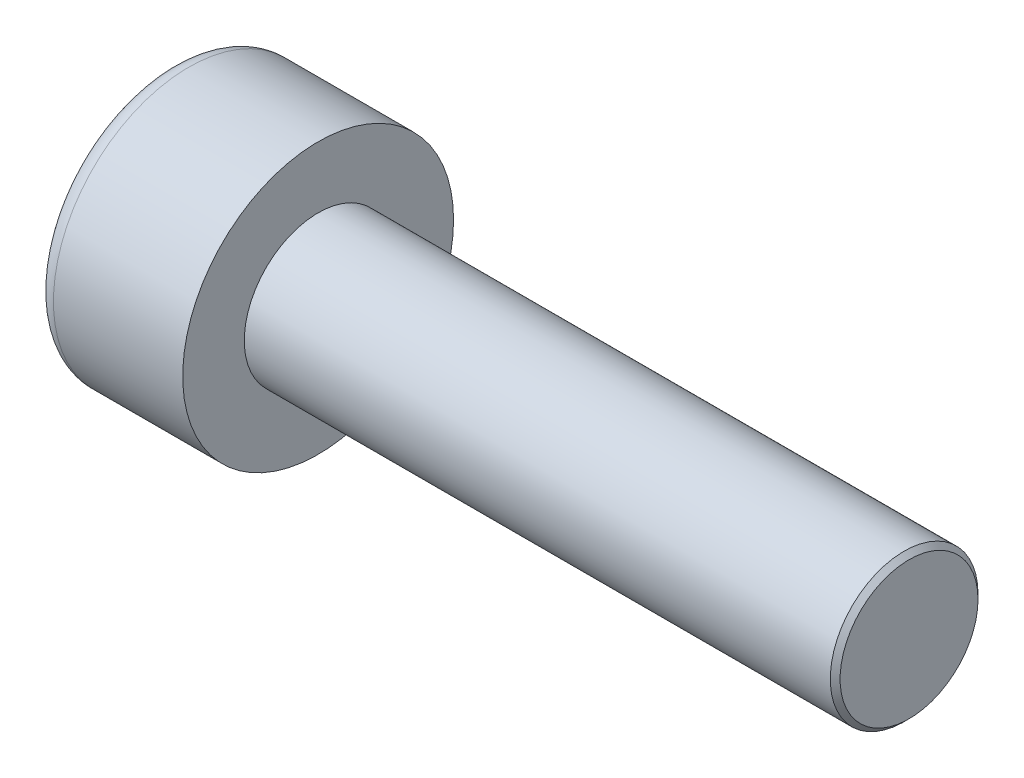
ISO-10303-21;
HEADER;
FILE_DESCRIPTION(('STEP AP214'),'2;1');
FILE_NAME('part.step','',(''),(''),'','','');
FILE_SCHEMA(('AUTOMOTIVE_DESIGN { 1 0 10303 214 1 1 1 1 }'));
ENDSEC;
DATA;
#1=APPLICATION_CONTEXT('core data for automotive mechanical design processes');
#2=APPLICATION_PROTOCOL_DEFINITION('international standard','automotive_design',2000,#1);
#3=PRODUCT_CONTEXT('',#1,'mechanical');
#4=PRODUCT('Part','Part','',(#3));
#5=PRODUCT_RELATED_PRODUCT_CATEGORY('part','',(#4));
#6=PRODUCT_DEFINITION_FORMATION('','',#4);
#7=PRODUCT_DEFINITION_CONTEXT('part definition',#1,'design');
#8=PRODUCT_DEFINITION('design','',#6,#7);
#9=PRODUCT_DEFINITION_SHAPE('','',#8);
#10=(LENGTH_UNIT() NAMED_UNIT(*) SI_UNIT(.MILLI.,.METRE.));
#11=(NAMED_UNIT(*) PLANE_ANGLE_UNIT() SI_UNIT($,.RADIAN.));
#12=(NAMED_UNIT(*) SI_UNIT($,.STERADIAN.) SOLID_ANGLE_UNIT());
#13=UNCERTAINTY_MEASURE_WITH_UNIT(LENGTH_MEASURE(1.E-05),#10,'distance_accuracy_value','');
#14=(GEOMETRIC_REPRESENTATION_CONTEXT(3) GLOBAL_UNCERTAINTY_ASSIGNED_CONTEXT((#13)) GLOBAL_UNIT_ASSIGNED_CONTEXT((#10,
#11,#12)) REPRESENTATION_CONTEXT('',''));
#15=CARTESIAN_POINT('',(0.,0.,0.));
#16=DIRECTION('',(0.,0.,1.));
#17=DIRECTION('',(1.,0.,0.));
#18=AXIS2_PLACEMENT_3D('',#15,#16,#17);
#19=CARTESIAN_POINT('',(1.3,0.,-1.44337567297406));
#20=DIRECTION('',(1.,0.,0.));
#21=DIRECTION('',(0.,0.,-1.));
#22=AXIS2_PLACEMENT_3D('',#19,#20,#21);
#23=PLANE('',#22);
#24=CARTESIAN_POINT('',(1.3,0.,0.));
#25=DIRECTION('',(1.,0.,0.));
#26=DIRECTION('',(0.,0.,-1.));
#27=AXIS2_PLACEMENT_3D('',#24,#25,#26);
#28=CIRCLE('',#27,1.25);
#29=CARTESIAN_POINT('',(1.3,-0.625,-1.08253175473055));
#30=VERTEX_POINT('',#29);
#31=CARTESIAN_POINT('',(1.3,-1.25,0.));
#32=VERTEX_POINT('',#31);
#33=EDGE_CURVE('E164',#30,#32,#28,.F.);
#34=ORIENTED_EDGE('',*,*,#33,.F.);
#35=DIRECTION('',(0.,0.866025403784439,-0.5));
#36=VECTOR('',#35,1.);
#37=CARTESIAN_POINT('',(1.3,-1.25,-0.721687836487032));
#38=LINE('',#37,#36);
#39=CARTESIAN_POINT('',(1.3,-1.25,-0.721687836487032));
#40=VERTEX_POINT('',#39);
#41=EDGE_CURVE('E172',#40,#30,#38,.T.);
#42=ORIENTED_EDGE('',*,*,#41,.F.);
#43=DIRECTION('',(0.,0.,-1.));
#44=VECTOR('',#43,1.);
#45=CARTESIAN_POINT('',(1.3,-1.25,0.721687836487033));
#46=LINE('',#45,#44);
#47=EDGE_CURVE('E189',#32,#40,#46,.T.);
#48=ORIENTED_EDGE('',*,*,#47,.F.);
#49=EDGE_LOOP('',(#34,#42,#48));
#50=FACE_BOUND('',#49,.T.);
#51=ADVANCED_FACE('F41',(#50),#23,.F.);
#52=CARTESIAN_POINT('',(1.3,-0.625,1.08253175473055));
#53=VERTEX_POINT('',#52);
#54=EDGE_CURVE('E294',#32,#53,#28,.F.);
#55=ORIENTED_EDGE('',*,*,#54,.F.);
#56=CARTESIAN_POINT('',(1.3,-1.25,0.721687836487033));
#57=VERTEX_POINT('',#56);
#58=EDGE_CURVE('E190',#57,#32,#46,.T.);
#59=ORIENTED_EDGE('',*,*,#58,.F.);
#60=DIRECTION('',(0.,-0.866025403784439,-0.5));
#61=VECTOR('',#60,1.);
#62=CARTESIAN_POINT('',(1.3,0.,1.44337567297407));
#63=LINE('',#62,#61);
#64=EDGE_CURVE('E185',#53,#57,#63,.T.);
#65=ORIENTED_EDGE('',*,*,#64,.F.);
#66=EDGE_LOOP('',(#55,#59,#65));
#67=FACE_BOUND('',#66,.T.);
#68=ADVANCED_FACE('F130',(#67),#23,.F.);
#69=CARTESIAN_POINT('',(1.3,0.625,1.08253175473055));
#70=VERTEX_POINT('',#69);
#71=EDGE_CURVE('E290',#53,#70,#28,.F.);
#72=ORIENTED_EDGE('',*,*,#71,.F.);
#73=CARTESIAN_POINT('',(1.3,0.,1.44337567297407));
#74=VERTEX_POINT('',#73);
#75=EDGE_CURVE('E186',#74,#53,#63,.T.);
#76=ORIENTED_EDGE('',*,*,#75,.F.);
#77=DIRECTION('',(0.,-0.866025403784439,0.5));
#78=VECTOR('',#77,1.);
#79=CARTESIAN_POINT('',(1.3,1.25,0.721687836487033));
#80=LINE('',#79,#78);
#81=EDGE_CURVE('E181',#70,#74,#80,.T.);
#82=ORIENTED_EDGE('',*,*,#81,.F.);
#83=EDGE_LOOP('',(#72,#76,#82));
#84=FACE_BOUND('',#83,.T.);
#85=ADVANCED_FACE('F136',(#84),#23,.F.);
#86=CARTESIAN_POINT('',(1.3,1.25,0.));
#87=VERTEX_POINT('',#86);
#88=EDGE_CURVE('E161',#70,#87,#28,.F.);
#89=ORIENTED_EDGE('',*,*,#88,.F.);
#90=CARTESIAN_POINT('',(1.3,1.25,0.721687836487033));
#91=VERTEX_POINT('',#90);
#92=EDGE_CURVE('E182',#91,#70,#80,.T.);
#93=ORIENTED_EDGE('',*,*,#92,.F.);
#94=DIRECTION('',(0.,0.,1.));
#95=VECTOR('',#94,1.);
#96=CARTESIAN_POINT('',(1.3,1.25,-0.721687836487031));
#97=LINE('',#96,#95);
#98=EDGE_CURVE('E176',#87,#91,#97,.T.);
#99=ORIENTED_EDGE('',*,*,#98,.F.);
#100=EDGE_LOOP('',(#89,#93,#99));
#101=FACE_BOUND('',#100,.T.);
#102=ADVANCED_FACE('F150',(#101),#23,.F.);
#103=CARTESIAN_POINT('',(1.3,0.,0.));
#104=DIRECTION('',(1.,0.,0.));
#105=DIRECTION('',(0.,0.,-1.));
#106=AXIS2_PLACEMENT_3D('',#103,#104,#105);
#107=CIRCLE('',#106,1.25);
#108=CARTESIAN_POINT('',(1.3,0.625,-1.08253175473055));
#109=VERTEX_POINT('',#108);
#110=EDGE_CURVE('E56',#109,#87,#107,.T.);
#111=ORIENTED_EDGE('',*,*,#110,.T.);
#112=CARTESIAN_POINT('',(1.3,1.25,-0.721687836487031));
#113=VERTEX_POINT('',#112);
#114=EDGE_CURVE('E169',#113,#87,#97,.T.);
#115=ORIENTED_EDGE('',*,*,#114,.F.);
#116=DIRECTION('',(0.,0.866025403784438,0.5));
#117=VECTOR('',#116,1.);
#118=CARTESIAN_POINT('',(1.3,0.,-1.44337567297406));
#119=LINE('',#118,#117);
#120=EDGE_CURVE('E166',#109,#113,#119,.T.);
#121=ORIENTED_EDGE('',*,*,#120,.F.);
#122=EDGE_LOOP('',(#111,#115,#121));
#123=FACE_BOUND('',#122,.T.);
#124=ADVANCED_FACE('F141',(#123),#23,.F.);
#125=EDGE_CURVE('E154',#109,#30,#28,.F.);
#126=ORIENTED_EDGE('',*,*,#125,.F.);
#127=CARTESIAN_POINT('',(1.3,0.,-1.44337567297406));
#128=VERTEX_POINT('',#127);
#129=EDGE_CURVE('E157',#128,#109,#119,.T.);
#130=ORIENTED_EDGE('',*,*,#129,.F.);
#131=EDGE_CURVE('E159',#30,#128,#38,.T.);
#132=ORIENTED_EDGE('',*,*,#131,.F.);
#133=EDGE_LOOP('',(#126,#130,#132));
#134=FACE_BOUND('',#133,.T.);
#135=ADVANCED_FACE('F132',(#134),#23,.F.);
#136=CARTESIAN_POINT('',(0.,0.,0.));
#137=DIRECTION('',(1.,0.,0.));
#138=DIRECTION('',(0.,0.,-1.));
#139=AXIS2_PLACEMENT_3D('',#136,#137,#138);
#140=PLANE('',#139);
#141=CARTESIAN_POINT('',(0.,0.,0.));
#142=DIRECTION('',(1.,0.,0.));
#143=DIRECTION('',(0.,0.,-1.));
#144=AXIS2_PLACEMENT_3D('',#141,#142,#143);
#145=CIRCLE('',#144,2.375);
#146=CARTESIAN_POINT('',(0.,0.,-2.375));
#147=VERTEX_POINT('',#146);
#148=EDGE_CURVE('E229',#147,#147,#145,.F.);
#149=ORIENTED_EDGE('',*,*,#148,.T.);
#150=EDGE_LOOP('',(#149));
#151=FACE_BOUND('',#150,.T.);
#152=DIRECTION('',(0.,0.866025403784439,-0.5));
#153=VECTOR('',#152,1.);
#154=CARTESIAN_POINT('',(0.,-1.25,-0.721687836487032));
#155=LINE('',#154,#153);
#156=CARTESIAN_POINT('',(0.,-1.25,-0.721687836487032));
#157=VERTEX_POINT('',#156);
#158=CARTESIAN_POINT('',(0.,0.,-1.44337567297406));
#159=VERTEX_POINT('',#158);
#160=EDGE_CURVE('E64',#157,#159,#155,.T.);
#161=ORIENTED_EDGE('',*,*,#160,.T.);
#162=DIRECTION('',(0.,0.866025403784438,0.5));
#163=VECTOR('',#162,1.);
#164=CARTESIAN_POINT('',(0.,0.,-1.44337567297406));
#165=LINE('',#164,#163);
#166=CARTESIAN_POINT('',(0.,1.25,-0.721687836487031));
#167=VERTEX_POINT('',#166);
#168=EDGE_CURVE('E195',#159,#167,#165,.T.);
#169=ORIENTED_EDGE('',*,*,#168,.T.);
#170=DIRECTION('',(0.,0.,1.));
#171=VECTOR('',#170,1.);
#172=CARTESIAN_POINT('',(0.,1.25,-0.721687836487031));
#173=LINE('',#172,#171);
#174=CARTESIAN_POINT('',(0.,1.25,0.721687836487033));
#175=VERTEX_POINT('',#174);
#176=EDGE_CURVE('E198',#167,#175,#173,.T.);
#177=ORIENTED_EDGE('',*,*,#176,.T.);
#178=DIRECTION('',(0.,-0.866025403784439,0.5));
#179=VECTOR('',#178,1.);
#180=CARTESIAN_POINT('',(0.,1.25,0.721687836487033));
#181=LINE('',#180,#179);
#182=CARTESIAN_POINT('',(0.,0.,1.44337567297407));
#183=VERTEX_POINT('',#182);
#184=EDGE_CURVE('E201',#175,#183,#181,.T.);
#185=ORIENTED_EDGE('',*,*,#184,.T.);
#186=DIRECTION('',(0.,-0.866025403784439,-0.5));
#187=VECTOR('',#186,1.);
#188=CARTESIAN_POINT('',(0.,0.,1.44337567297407));
#189=LINE('',#188,#187);
#190=CARTESIAN_POINT('',(0.,-1.25,0.721687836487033));
#191=VERTEX_POINT('',#190);
#192=EDGE_CURVE('E204',#183,#191,#189,.T.);
#193=ORIENTED_EDGE('',*,*,#192,.T.);
#194=DIRECTION('',(0.,0.,-1.));
#195=VECTOR('',#194,1.);
#196=CARTESIAN_POINT('',(0.,-1.25,0.721687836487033));
#197=LINE('',#196,#195);
#198=EDGE_CURVE('E207',#191,#157,#197,.T.);
#199=ORIENTED_EDGE('',*,*,#198,.T.);
#200=EDGE_LOOP('',(#161,#169,#177,#185,#193,#199));
#201=FACE_BOUND('',#200,.T.);
#202=ADVANCED_FACE('F140',(#151,#201),#140,.F.);
#203=CARTESIAN_POINT('',(3.,0.,0.));
#204=DIRECTION('',(1.,0.,0.));
#205=DIRECTION('',(0.,0.,-1.));
#206=AXIS2_PLACEMENT_3D('',#203,#204,#205);
#207=PLANE('',#206);
#208=CARTESIAN_POINT('',(3.,0.,0.));
#209=DIRECTION('',(1.,0.,0.));
#210=DIRECTION('',(0.,0.,-1.));
#211=AXIS2_PLACEMENT_3D('',#208,#209,#210);
#212=CIRCLE('',#211,2.75);
#213=CARTESIAN_POINT('',(3.,0.,-2.75));
#214=VERTEX_POINT('',#213);
#215=EDGE_CURVE('E162',#214,#214,#212,.T.);
#216=ORIENTED_EDGE('',*,*,#215,.T.);
#217=EDGE_LOOP('',(#216));
#218=FACE_BOUND('',#217,.T.);
#219=CARTESIAN_POINT('',(3.,0.,0.));
#220=DIRECTION('',(1.,0.,0.));
#221=DIRECTION('',(0.,0.,-1.));
#222=AXIS2_PLACEMENT_3D('',#219,#220,#221);
#223=CIRCLE('',#222,1.5);
#224=CARTESIAN_POINT('',(3.,0.,-1.5));
#225=VERTEX_POINT('',#224);
#226=EDGE_CURVE('E220',#225,#225,#223,.T.);
#227=ORIENTED_EDGE('',*,*,#226,.F.);
#228=EDGE_LOOP('',(#227));
#229=FACE_BOUND('',#228,.T.);
#230=ADVANCED_FACE('F147',(#218,#229),#207,.T.);
#231=CARTESIAN_POINT('',(3.,0.,0.));
#232=DIRECTION('',(-1.,0.,0.));
#233=DIRECTION('',(0.,0.,1.));
#234=AXIS2_PLACEMENT_3D('',#231,#232,#233);
#235=CYLINDRICAL_SURFACE('',#234,2.75);
#236=CARTESIAN_POINT('',(0.375,0.,0.));
#237=DIRECTION('',(1.,0.,0.));
#238=DIRECTION('',(0.,0.,-1.));
#239=AXIS2_PLACEMENT_3D('',#236,#237,#238);
#240=CIRCLE('',#239,2.75);
#241=CARTESIAN_POINT('',(0.375,0.,-2.75));
#242=VERTEX_POINT('',#241);
#243=EDGE_CURVE('E226',#242,#242,#240,.T.);
#244=ORIENTED_EDGE('',*,*,#243,.T.);
#245=EDGE_LOOP('',(#244));
#246=FACE_BOUND('',#245,.T.);
#247=ORIENTED_EDGE('',*,*,#215,.F.);
#248=EDGE_LOOP('',(#247));
#249=FACE_BOUND('',#248,.T.);
#250=ADVANCED_FACE('F245',(#246,#249),#235,.T.);
#251=CARTESIAN_POINT('',(15.,0.,0.));
#252=DIRECTION('',(-1.,0.,0.));
#253=DIRECTION('',(0.,0.,1.));
#254=AXIS2_PLACEMENT_3D('',#251,#252,#253);
#255=CYLINDRICAL_SURFACE('',#254,1.5);
#256=CARTESIAN_POINT('',(14.9,0.,0.));
#257=DIRECTION('',(1.,0.,0.));
#258=DIRECTION('',(0.,0.,-1.));
#259=AXIS2_PLACEMENT_3D('',#256,#257,#258);
#260=CIRCLE('',#259,1.5);
#261=CARTESIAN_POINT('',(14.9,0.,-1.5));
#262=VERTEX_POINT('',#261);
#263=EDGE_CURVE('E11',#262,#262,#260,.F.);
#264=ORIENTED_EDGE('',*,*,#263,.T.);
#265=EDGE_LOOP('',(#264));
#266=FACE_BOUND('',#265,.T.);
#267=ORIENTED_EDGE('',*,*,#226,.T.);
#268=EDGE_LOOP('',(#267));
#269=FACE_BOUND('',#268,.T.);
#270=ADVANCED_FACE('F242',(#266,#269),#255,.T.);
#271=CARTESIAN_POINT('',(15.,0.,0.));
#272=DIRECTION('',(1.,0.,0.));
#273=DIRECTION('',(0.,0.,-1.));
#274=AXIS2_PLACEMENT_3D('',#271,#272,#273);
#275=PLANE('',#274);
#276=CARTESIAN_POINT('',(15.,0.,0.));
#277=DIRECTION('',(1.,0.,0.));
#278=DIRECTION('',(0.,0.,-1.));
#279=AXIS2_PLACEMENT_3D('',#276,#277,#278);
#280=CIRCLE('',#279,1.4);
#281=CARTESIAN_POINT('',(15.,0.,-1.4));
#282=VERTEX_POINT('',#281);
#283=EDGE_CURVE('E49',#282,#282,#280,.T.);
#284=ORIENTED_EDGE('',*,*,#283,.T.);
#285=EDGE_LOOP('',(#284));
#286=FACE_BOUND('',#285,.T.);
#287=ADVANCED_FACE('F234',(#286),#275,.T.);
#288=CARTESIAN_POINT('',(1.3,-1.25,-0.721687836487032));
#289=DIRECTION('',(0.,0.5,0.866025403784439));
#290=DIRECTION('',(0.,-0.866025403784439,0.5));
#291=AXIS2_PLACEMENT_3D('',#288,#289,#290);
#292=PLANE('',#291);
#293=ORIENTED_EDGE('',*,*,#160,.F.);
#294=DIRECTION('',(-1.,0.,0.));
#295=VECTOR('',#294,1.);
#296=CARTESIAN_POINT('',(1.3,-1.25,-0.721687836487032));
#297=LINE('',#296,#295);
#298=EDGE_CURVE('E193',#40,#157,#297,.T.);
#299=ORIENTED_EDGE('',*,*,#298,.F.);
#300=ORIENTED_EDGE('',*,*,#41,.T.);
#301=ORIENTED_EDGE('',*,*,#131,.T.);
#302=DIRECTION('',(-1.,0.,0.));
#303=VECTOR('',#302,1.);
#304=CARTESIAN_POINT('',(1.3,0.,-1.44337567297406));
#305=LINE('',#304,#303);
#306=EDGE_CURVE('E175',#128,#159,#305,.T.);
#307=ORIENTED_EDGE('',*,*,#306,.T.);
#308=EDGE_LOOP('',(#293,#299,#300,#301,#307));
#309=FACE_BOUND('',#308,.T.);
#310=ADVANCED_FACE('F260',(#309),#292,.T.);
#311=CARTESIAN_POINT('',(1.3,0.,-1.44337567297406));
#312=DIRECTION('',(0.,-0.5,0.866025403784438));
#313=DIRECTION('',(0.,-0.866025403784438,-0.5));
#314=AXIS2_PLACEMENT_3D('',#311,#312,#313);
#315=PLANE('',#314);
#316=ORIENTED_EDGE('',*,*,#168,.F.);
#317=ORIENTED_EDGE('',*,*,#306,.F.);
#318=ORIENTED_EDGE('',*,*,#129,.T.);
#319=ORIENTED_EDGE('',*,*,#120,.T.);
#320=DIRECTION('',(-1.,0.,0.));
#321=VECTOR('',#320,1.);
#322=CARTESIAN_POINT('',(1.3,1.25,-0.721687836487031));
#323=LINE('',#322,#321);
#324=EDGE_CURVE('E217',#113,#167,#323,.T.);
#325=ORIENTED_EDGE('',*,*,#324,.T.);
#326=EDGE_LOOP('',(#316,#317,#318,#319,#325));
#327=FACE_BOUND('',#326,.T.);
#328=ADVANCED_FACE('F174',(#327),#315,.T.);
#329=CARTESIAN_POINT('',(1.3,1.25,-0.721687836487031));
#330=DIRECTION('',(0.,-1.,0.));
#331=DIRECTION('',(0.,0.,-1.));
#332=AXIS2_PLACEMENT_3D('',#329,#330,#331);
#333=PLANE('',#332);
#334=ORIENTED_EDGE('',*,*,#176,.F.);
#335=ORIENTED_EDGE('',*,*,#324,.F.);
#336=ORIENTED_EDGE('',*,*,#114,.T.);
#337=ORIENTED_EDGE('',*,*,#98,.T.);
#338=DIRECTION('',(-1.,0.,0.));
#339=VECTOR('',#338,1.);
#340=CARTESIAN_POINT('',(1.3,1.25,0.721687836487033));
#341=LINE('',#340,#339);
#342=EDGE_CURVE('E215',#91,#175,#341,.T.);
#343=ORIENTED_EDGE('',*,*,#342,.T.);
#344=EDGE_LOOP('',(#334,#335,#336,#337,#343));
#345=FACE_BOUND('',#344,.T.);
#346=ADVANCED_FACE('F265',(#345),#333,.T.);
#347=CARTESIAN_POINT('',(1.3,1.25,0.721687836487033));
#348=DIRECTION('',(0.,-0.5,-0.866025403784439));
#349=DIRECTION('',(0.,0.866025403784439,-0.5));
#350=AXIS2_PLACEMENT_3D('',#347,#348,#349);
#351=PLANE('',#350);
#352=ORIENTED_EDGE('',*,*,#184,.F.);
#353=ORIENTED_EDGE('',*,*,#342,.F.);
#354=ORIENTED_EDGE('',*,*,#92,.T.);
#355=ORIENTED_EDGE('',*,*,#81,.T.);
#356=DIRECTION('',(-1.,0.,0.));
#357=VECTOR('',#356,1.);
#358=CARTESIAN_POINT('',(1.3,0.,1.44337567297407));
#359=LINE('',#358,#357);
#360=EDGE_CURVE('E213',#74,#183,#359,.T.);
#361=ORIENTED_EDGE('',*,*,#360,.T.);
#362=EDGE_LOOP('',(#352,#353,#354,#355,#361));
#363=FACE_BOUND('',#362,.T.);
#364=ADVANCED_FACE('F268',(#363),#351,.T.);
#365=CARTESIAN_POINT('',(1.3,0.,1.44337567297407));
#366=DIRECTION('',(0.,0.5,-0.866025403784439));
#367=DIRECTION('',(0.,0.866025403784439,0.5));
#368=AXIS2_PLACEMENT_3D('',#365,#366,#367);
#369=PLANE('',#368);
#370=ORIENTED_EDGE('',*,*,#192,.F.);
#371=ORIENTED_EDGE('',*,*,#360,.F.);
#372=ORIENTED_EDGE('',*,*,#75,.T.);
#373=ORIENTED_EDGE('',*,*,#64,.T.);
#374=DIRECTION('',(-1.,0.,0.));
#375=VECTOR('',#374,1.);
#376=CARTESIAN_POINT('',(1.3,-1.25,0.721687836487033));
#377=LINE('',#376,#375);
#378=EDGE_CURVE('E211',#57,#191,#377,.T.);
#379=ORIENTED_EDGE('',*,*,#378,.T.);
#380=EDGE_LOOP('',(#370,#371,#372,#373,#379));
#381=FACE_BOUND('',#380,.T.);
#382=ADVANCED_FACE('F125',(#381),#369,.T.);
#383=CARTESIAN_POINT('',(1.3,-1.25,0.721687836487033));
#384=DIRECTION('',(0.,1.,0.));
#385=DIRECTION('',(0.,0.,1.));
#386=AXIS2_PLACEMENT_3D('',#383,#384,#385);
#387=PLANE('',#386);
#388=ORIENTED_EDGE('',*,*,#198,.F.);
#389=ORIENTED_EDGE('',*,*,#378,.F.);
#390=ORIENTED_EDGE('',*,*,#58,.T.);
#391=ORIENTED_EDGE('',*,*,#47,.T.);
#392=ORIENTED_EDGE('',*,*,#298,.T.);
#393=EDGE_LOOP('',(#388,#389,#390,#391,#392));
#394=FACE_BOUND('',#393,.T.);
#395=ADVANCED_FACE('F118',(#394),#387,.T.);
#396=CARTESIAN_POINT('',(1.3,0.,0.));
#397=DIRECTION('',(-1.,0.,0.));
#398=DIRECTION('',(0.,0.,1.));
#399=AXIS2_PLACEMENT_3D('',#396,#397,#398);
#400=CONICAL_SURFACE('',#399,1.25,1.04719755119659);
#401=CARTESIAN_POINT('',(2.02168783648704,0.,0.));
#402=VERTEX_POINT('',#401);
#403=VERTEX_LOOP('',#402);
#404=FACE_BOUND('',#403,.T.);
#405=ORIENTED_EDGE('',*,*,#110,.F.);
#406=ORIENTED_EDGE('',*,*,#125,.T.);
#407=ORIENTED_EDGE('',*,*,#33,.T.);
#408=ORIENTED_EDGE('',*,*,#54,.T.);
#409=ORIENTED_EDGE('',*,*,#71,.T.);
#410=ORIENTED_EDGE('',*,*,#88,.T.);
#411=EDGE_LOOP('',(#405,#406,#407,#408,#409,#410));
#412=FACE_BOUND('',#411,.T.);
#413=ADVANCED_FACE('F115',(#404,#412),#400,.F.);
#414=CARTESIAN_POINT('',(0.375,0.,0.));
#415=DIRECTION('',(1.,0.,0.));
#416=DIRECTION('',(0.,0.,-1.));
#417=AXIS2_PLACEMENT_3D('',#414,#415,#416);
#418=TOROIDAL_SURFACE('',#417,2.375,0.375);
#419=ORIENTED_EDGE('',*,*,#148,.F.);
#420=EDGE_LOOP('',(#419));
#421=FACE_BOUND('',#420,.T.);
#422=ORIENTED_EDGE('',*,*,#243,.F.);
#423=EDGE_LOOP('',(#422));
#424=FACE_BOUND('',#423,.T.);
#425=ADVANCED_FACE('F117',(#421,#424),#418,.T.);
#426=CARTESIAN_POINT('',(15.,0.,0.));
#427=DIRECTION('',(-1.,0.,0.));
#428=DIRECTION('',(0.,0.,1.));
#429=AXIS2_PLACEMENT_3D('',#426,#427,#428);
#430=CONICAL_SURFACE('',#429,1.4,0.785398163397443);
#431=ORIENTED_EDGE('',*,*,#263,.F.);
#432=EDGE_LOOP('',(#431));
#433=FACE_BOUND('',#432,.T.);
#434=ORIENTED_EDGE('',*,*,#283,.F.);
#435=EDGE_LOOP('',(#434));
#436=FACE_BOUND('',#435,.T.);
#437=ADVANCED_FACE('F43',(#433,#436),#430,.T.);
#438=CLOSED_SHELL('',(#51,#68,#85,#102,#124,#135,#202,#230,#250,#270,#287,#310,#328,#346,#364,
#382,#395,#413,#425,#437));
#439=MANIFOLD_SOLID_BREP('B2',#438);
#440=ADVANCED_BREP_SHAPE_REPRESENTATION('',(#18,#439),#14);
#441=SHAPE_DEFINITION_REPRESENTATION(#9,#440);
ENDSEC;
END-ISO-10303-21;
